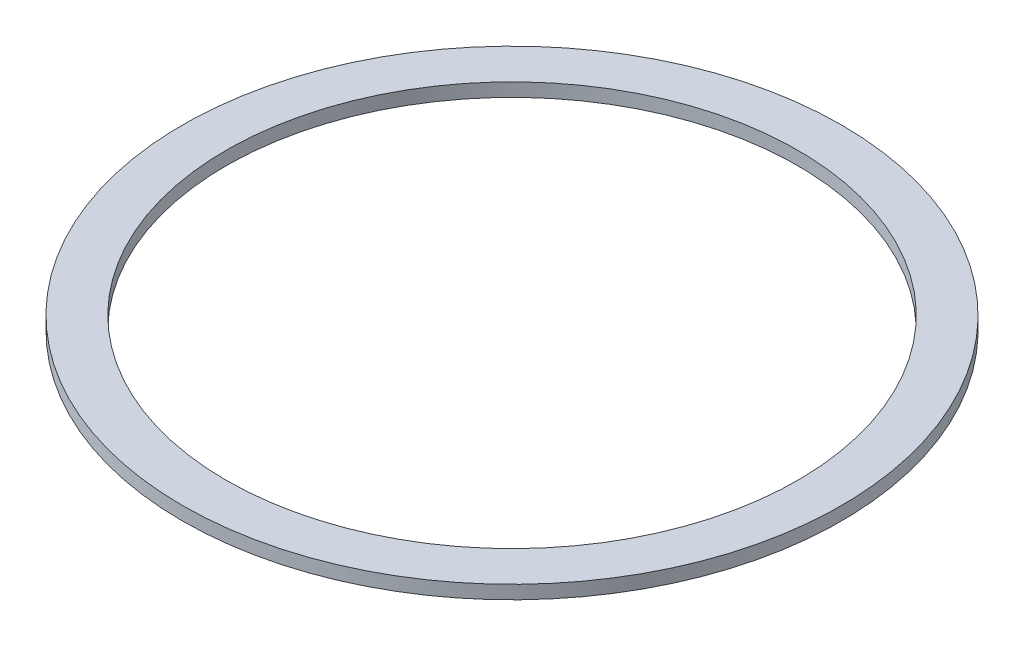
ISO-10303-21;
HEADER;
FILE_DESCRIPTION(('STEP AP214'),'2;1');
FILE_NAME('part.step','',(''),(''),'','','');
FILE_SCHEMA(('AUTOMOTIVE_DESIGN { 1 0 10303 214 1 1 1 1 }'));
ENDSEC;
DATA;
#1=APPLICATION_CONTEXT('core data for automotive mechanical design processes');
#2=APPLICATION_PROTOCOL_DEFINITION('international standard','automotive_design',2000,#1);
#3=PRODUCT_CONTEXT('',#1,'mechanical');
#4=PRODUCT('Part','Part','',(#3));
#5=PRODUCT_RELATED_PRODUCT_CATEGORY('part','',(#4));
#6=PRODUCT_DEFINITION_FORMATION('','',#4);
#7=PRODUCT_DEFINITION_CONTEXT('part definition',#1,'design');
#8=PRODUCT_DEFINITION('design','',#6,#7);
#9=PRODUCT_DEFINITION_SHAPE('','',#8);
#10=(LENGTH_UNIT() NAMED_UNIT(*) SI_UNIT(.MILLI.,.METRE.));
#11=(NAMED_UNIT(*) PLANE_ANGLE_UNIT() SI_UNIT($,.RADIAN.));
#12=(NAMED_UNIT(*) SI_UNIT($,.STERADIAN.) SOLID_ANGLE_UNIT());
#13=UNCERTAINTY_MEASURE_WITH_UNIT(LENGTH_MEASURE(1.E-05),#10,'distance_accuracy_value','');
#14=(GEOMETRIC_REPRESENTATION_CONTEXT(3) GLOBAL_UNCERTAINTY_ASSIGNED_CONTEXT((#13)) GLOBAL_UNIT_ASSIGNED_CONTEXT((#10,
#11,#12)) REPRESENTATION_CONTEXT('',''));
#15=CARTESIAN_POINT('',(0.,0.,0.));
#16=DIRECTION('',(0.,0.,1.));
#17=DIRECTION('',(1.,0.,0.));
#18=AXIS2_PLACEMENT_3D('',#15,#16,#17);
#19=CARTESIAN_POINT('',(0.,4.,0.));
#20=DIRECTION('',(0.,1.,0.));
#21=DIRECTION('',(0.,0.,1.));
#22=AXIS2_PLACEMENT_3D('',#19,#20,#21);
#23=PLANE('',#22);
#24=CARTESIAN_POINT('',(0.,4.,0.));
#25=DIRECTION('',(0.,1.,0.));
#26=DIRECTION('',(0.,0.,1.));
#27=AXIS2_PLACEMENT_3D('',#24,#25,#26);
#28=CIRCLE('',#27,98.);
#29=CARTESIAN_POINT('',(0.,4.,98.));
#30=VERTEX_POINT('',#29);
#31=EDGE_CURVE('E10',#30,#30,#28,.T.);
#32=ORIENTED_EDGE('',*,*,#31,.T.);
#33=EDGE_LOOP('',(#32));
#34=FACE_BOUND('',#33,.T.);
#35=CARTESIAN_POINT('',(0.,4.,0.));
#36=DIRECTION('',(0.,1.,0.));
#37=DIRECTION('',(0.,0.,1.));
#38=AXIS2_PLACEMENT_3D('',#35,#36,#37);
#39=CIRCLE('',#38,85.);
#40=CARTESIAN_POINT('',(0.,4.,85.));
#41=VERTEX_POINT('',#40);
#42=EDGE_CURVE('E43',#41,#41,#39,.T.);
#43=ORIENTED_EDGE('',*,*,#42,.F.);
#44=EDGE_LOOP('',(#43));
#45=FACE_BOUND('',#44,.T.);
#46=ADVANCED_FACE('F32',(#34,#45),#23,.T.);
#47=CARTESIAN_POINT('',(0.,0.,0.));
#48=DIRECTION('',(0.,1.,0.));
#49=DIRECTION('',(0.,0.,1.));
#50=AXIS2_PLACEMENT_3D('',#47,#48,#49);
#51=PLANE('',#50);
#52=CARTESIAN_POINT('',(0.,0.,0.));
#53=DIRECTION('',(0.,1.,0.));
#54=DIRECTION('',(0.,0.,1.));
#55=AXIS2_PLACEMENT_3D('',#52,#53,#54);
#56=CIRCLE('',#55,98.);
#57=CARTESIAN_POINT('',(0.,0.,98.));
#58=VERTEX_POINT('',#57);
#59=EDGE_CURVE('E36',#58,#58,#56,.T.);
#60=ORIENTED_EDGE('',*,*,#59,.F.);
#61=EDGE_LOOP('',(#60));
#62=FACE_BOUND('',#61,.T.);
#63=CARTESIAN_POINT('',(0.,0.,0.));
#64=DIRECTION('',(0.,1.,0.));
#65=DIRECTION('',(0.,0.,1.));
#66=AXIS2_PLACEMENT_3D('',#63,#64,#65);
#67=CIRCLE('',#66,85.);
#68=CARTESIAN_POINT('',(0.,0.,85.));
#69=VERTEX_POINT('',#68);
#70=EDGE_CURVE('E45',#69,#69,#67,.T.);
#71=ORIENTED_EDGE('',*,*,#70,.T.);
#72=EDGE_LOOP('',(#71));
#73=FACE_BOUND('',#72,.T.);
#74=ADVANCED_FACE('F55',(#62,#73),#51,.F.);
#75=CARTESIAN_POINT('',(0.,4.,0.));
#76=DIRECTION('',(0.,-1.,0.));
#77=DIRECTION('',(0.,0.,-1.));
#78=AXIS2_PLACEMENT_3D('',#75,#76,#77);
#79=CYLINDRICAL_SURFACE('',#78,98.);
#80=ORIENTED_EDGE('',*,*,#31,.F.);
#81=EDGE_LOOP('',(#80));
#82=FACE_BOUND('',#81,.T.);
#83=ORIENTED_EDGE('',*,*,#59,.T.);
#84=EDGE_LOOP('',(#83));
#85=FACE_BOUND('',#84,.T.);
#86=ADVANCED_FACE('F34',(#82,#85),#79,.T.);
#87=CARTESIAN_POINT('',(0.,4.,0.));
#88=DIRECTION('',(0.,-1.,0.));
#89=DIRECTION('',(0.,0.,-1.));
#90=AXIS2_PLACEMENT_3D('',#87,#88,#89);
#91=CYLINDRICAL_SURFACE('',#90,85.);
#92=ORIENTED_EDGE('',*,*,#42,.T.);
#93=EDGE_LOOP('',(#92));
#94=FACE_BOUND('',#93,.T.);
#95=ORIENTED_EDGE('',*,*,#70,.F.);
#96=EDGE_LOOP('',(#95));
#97=FACE_BOUND('',#96,.T.);
#98=ADVANCED_FACE('F51',(#94,#97),#91,.F.);
#99=CLOSED_SHELL('',(#46,#74,#86,#98));
#100=MANIFOLD_SOLID_BREP('B2',#99);
#101=ADVANCED_BREP_SHAPE_REPRESENTATION('',(#18,#100),#14);
#102=SHAPE_DEFINITION_REPRESENTATION(#9,#101);
ENDSEC;
END-ISO-10303-21;
